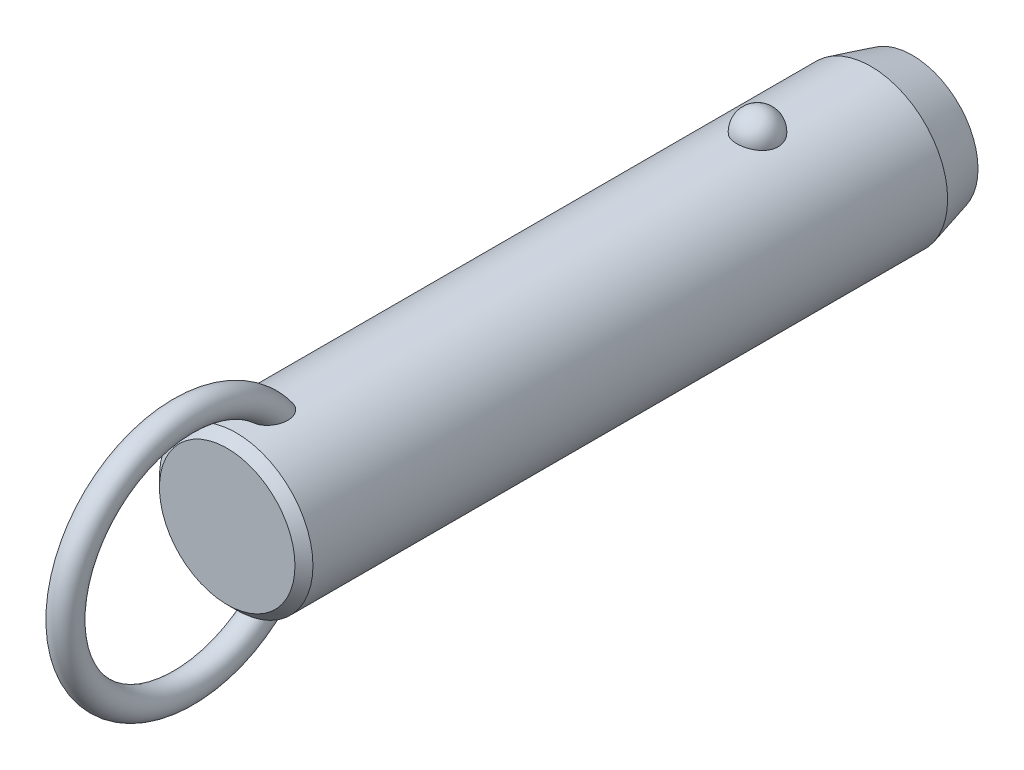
ISO-10303-21;
HEADER;
FILE_DESCRIPTION(('STEP AP214'),'2;1');
FILE_NAME('part.step','',(''),(''),'','','');
FILE_SCHEMA(('AUTOMOTIVE_DESIGN { 1 0 10303 214 1 1 1 1 }'));
ENDSEC;
DATA;
#1=APPLICATION_CONTEXT('core data for automotive mechanical design processes');
#2=APPLICATION_PROTOCOL_DEFINITION('international standard','automotive_design',2000,#1);
#3=PRODUCT_CONTEXT('',#1,'mechanical');
#4=PRODUCT('Part','Part','',(#3));
#5=PRODUCT_RELATED_PRODUCT_CATEGORY('part','',(#4));
#6=PRODUCT_DEFINITION_FORMATION('','',#4);
#7=PRODUCT_DEFINITION_CONTEXT('part definition',#1,'design');
#8=PRODUCT_DEFINITION('design','',#6,#7);
#9=PRODUCT_DEFINITION_SHAPE('','',#8);
#10=(LENGTH_UNIT() NAMED_UNIT(*) SI_UNIT(.MILLI.,.METRE.));
#11=(NAMED_UNIT(*) PLANE_ANGLE_UNIT() SI_UNIT($,.RADIAN.));
#12=(NAMED_UNIT(*) SI_UNIT($,.STERADIAN.) SOLID_ANGLE_UNIT());
#13=UNCERTAINTY_MEASURE_WITH_UNIT(LENGTH_MEASURE(1.E-05),#10,'distance_accuracy_value','');
#14=(GEOMETRIC_REPRESENTATION_CONTEXT(3) GLOBAL_UNCERTAINTY_ASSIGNED_CONTEXT((#13)) GLOBAL_UNIT_ASSIGNED_CONTEXT((#10,
#11,#12)) REPRESENTATION_CONTEXT('',''));
#15=CARTESIAN_POINT('',(0.,0.,0.));
#16=DIRECTION('',(0.,0.,1.));
#17=DIRECTION('',(1.,0.,0.));
#18=AXIS2_PLACEMENT_3D('',#15,#16,#17);
#19=CARTESIAN_POINT('',(0.,0.,61.));
#20=DIRECTION('',(0.,0.,-1.));
#21=DIRECTION('',(-1.,0.,0.));
#22=AXIS2_PLACEMENT_3D('',#19,#20,#21);
#23=CYLINDRICAL_SURFACE('',#22,11.1);
#24=CARTESIAN_POINT('',(2.9724815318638,10.6945945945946,-3.));
#25=CARTESIAN_POINT('',(2.97247830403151,10.6945972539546,-2.83225059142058));
#26=CARTESIAN_POINT('',(2.95876598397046,10.6984356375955,-2.6644597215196));
#27=CARTESIAN_POINT('',(2.90424529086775,10.7133624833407,-2.33362381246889));
#28=CARTESIAN_POINT('',(2.8634252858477,10.7244540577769,-2.1705808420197));
#29=CARTESIAN_POINT('',(2.75573657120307,10.7526272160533,-1.85396767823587));
#30=CARTESIAN_POINT('',(2.68887937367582,10.7697061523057,-1.70039333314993));
#31=CARTESIAN_POINT('',(2.53079696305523,10.8079438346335,-1.40691598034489));
#32=CARTESIAN_POINT('',(2.43957264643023,10.8291024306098,-1.2670124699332));
#33=CARTESIAN_POINT('',(2.23458150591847,10.8732541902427,-1.00409565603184));
#34=CARTESIAN_POINT('',(2.12071295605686,10.8962553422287,-0.881162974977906));
#35=CARTESIAN_POINT('',(1.87365402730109,10.9414421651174,-0.656352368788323));
#36=CARTESIAN_POINT('',(1.74046358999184,10.9636278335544,-0.554474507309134));
#37=CARTESIAN_POINT('',(1.45872188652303,11.0046495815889,-0.374872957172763));
#38=CARTESIAN_POINT('',(1.31021276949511,11.0234944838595,-0.297085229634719));
#39=CARTESIAN_POINT('',(1.00170030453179,11.0557957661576,-0.16752977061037));
#40=CARTESIAN_POINT('',(0.841698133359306,11.0692526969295,-0.115759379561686));
#41=CARTESIAN_POINT('',(0.517607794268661,11.0890932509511,-0.0403925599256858));
#42=CARTESIAN_POINT('',(0.353633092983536,11.0955916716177,-0.0163383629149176));
#43=CARTESIAN_POINT('',(0.0238420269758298,11.1011989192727,0.00445177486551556));
#44=CARTESIAN_POINT('',(-0.141974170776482,11.1003084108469,0.00119017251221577));
#45=CARTESIAN_POINT('',(-0.468405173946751,11.0912990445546,-0.032323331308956));
#46=CARTESIAN_POINT('',(-0.629059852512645,11.0832767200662,-0.0622147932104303));
#47=CARTESIAN_POINT('',(-0.942937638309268,11.0609962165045,-0.147645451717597));
#48=CARTESIAN_POINT('',(-1.09616062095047,11.0467379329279,-0.203185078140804));
#49=CARTESIAN_POINT('',(-1.39181061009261,11.0134071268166,-0.3387529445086));
#50=CARTESIAN_POINT('',(-1.53417383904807,10.9943086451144,-0.418913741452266));
#51=CARTESIAN_POINT('',(-1.80342160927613,10.9533667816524,-0.60144882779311));
#52=CARTESIAN_POINT('',(-1.9303046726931,10.9315231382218,-0.703825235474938));
#53=CARTESIAN_POINT('',(-2.16747598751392,10.887005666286,-0.930091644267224));
#54=CARTESIAN_POINT('',(-2.27742774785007,10.8643239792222,-1.05433291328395));
#55=CARTESIAN_POINT('',(-2.47517316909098,10.8209886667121,-1.31966633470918));
#56=CARTESIAN_POINT('',(-2.56296538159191,10.8003351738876,-1.46075958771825));
#57=CARTESIAN_POINT('',(-2.71500300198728,10.7631304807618,-1.75753646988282));
#58=CARTESIAN_POINT('',(-2.77898901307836,10.7466250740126,-1.91335887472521));
#59=CARTESIAN_POINT('',(-2.88046189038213,10.7198747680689,-2.2339152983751));
#60=CARTESIAN_POINT('',(-2.91794947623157,10.709629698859,-2.39864907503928));
#61=CARTESIAN_POINT('',(-2.96537819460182,10.6965949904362,-2.73165170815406));
#62=CARTESIAN_POINT('',(-2.97542891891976,10.693775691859,-2.89990378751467));
#63=CARTESIAN_POINT('',(-2.96804271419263,10.6958279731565,-3.235752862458));
#64=CARTESIAN_POINT('',(-2.95060646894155,10.7006993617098,-3.40334987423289));
#65=CARTESIAN_POINT('',(-2.88883358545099,10.71753912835,-3.73233906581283));
#66=CARTESIAN_POINT('',(-2.84462026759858,10.7294749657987,-3.89375610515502));
#67=CARTESIAN_POINT('',(-2.73050447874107,10.7590797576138,-4.20667949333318));
#68=CARTESIAN_POINT('',(-2.66060103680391,10.7767489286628,-4.35818546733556));
#69=CARTESIAN_POINT('',(-2.49642559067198,10.8159599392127,-4.6478542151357));
#70=CARTESIAN_POINT('',(-2.40203047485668,10.8375211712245,-4.78594458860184));
#71=CARTESIAN_POINT('',(-2.19143488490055,10.8820570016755,-5.0441038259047));
#72=CARTESIAN_POINT('',(-2.07523364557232,10.9050316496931,-5.16417205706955));
#73=CARTESIAN_POINT('',(-1.82361254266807,10.9499219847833,-5.38334833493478));
#74=CARTESIAN_POINT('',(-1.68812945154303,10.9718338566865,-5.48238464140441));
#75=CARTESIAN_POINT('',(-1.40191298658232,11.0120611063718,-5.65618873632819));
#76=CARTESIAN_POINT('',(-1.25118062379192,11.0303767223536,-5.73095813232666));
#77=CARTESIAN_POINT('',(-0.940570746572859,11.0611653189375,-5.85334725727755));
#78=CARTESIAN_POINT('',(-0.780821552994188,11.0737044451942,-5.90127578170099));
#79=CARTESIAN_POINT('',(-0.455204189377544,11.0918598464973,-5.96992976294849));
#80=CARTESIAN_POINT('',(-0.289336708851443,11.0974768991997,-5.99065827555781));
#81=CARTESIAN_POINT('',(0.0406846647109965,11.1011307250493,-6.00418773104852));
#82=CARTESIAN_POINT('',(0.20481742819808,11.099299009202,-5.99747318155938));
#83=CARTESIAN_POINT('',(0.529553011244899,11.088551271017,-5.9574031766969));
#84=CARTESIAN_POINT('',(0.69015594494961,11.0796354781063,-5.92404858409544));
#85=CARTESIAN_POINT('',(1.0027760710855,11.0557204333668,-5.83180084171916));
#86=CARTESIAN_POINT('',(1.15482001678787,11.0407414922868,-5.77299291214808));
#87=CARTESIAN_POINT('',(1.44678373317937,11.0062913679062,-5.63147366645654));
#88=CARTESIAN_POINT('',(1.58670279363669,10.9868199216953,-5.54876095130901));
#89=CARTESIAN_POINT('',(1.8527023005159,10.9451315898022,-5.36027644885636));
#90=CARTESIAN_POINT('',(1.97855158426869,10.9228788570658,-5.25418644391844));
#91=CARTESIAN_POINT('',(2.21080872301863,10.8782509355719,-5.02251354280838));
#92=CARTESIAN_POINT('',(2.31721312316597,10.8558757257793,-4.89692718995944));
#93=CARTESIAN_POINT('',(2.5094551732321,10.8130715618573,-4.62745408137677));
#94=CARTESIAN_POINT('',(2.59493284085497,10.7926798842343,-4.48330448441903));
#95=CARTESIAN_POINT('',(2.740862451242,10.7565495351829,-4.18236358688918));
#96=CARTESIAN_POINT('',(2.80132490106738,10.7408089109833,-4.02557762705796));
#97=CARTESIAN_POINT('',(2.88959070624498,10.7173718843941,-3.72475308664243));
#98=CARTESIAN_POINT('',(2.92062102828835,10.7088950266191,-3.58171216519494));
#99=CARTESIAN_POINT('',(2.96206765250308,10.6975052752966,-3.29245795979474));
#100=CARTESIAN_POINT('',(2.97248434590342,10.6945922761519,-3.14624473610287));
#101=CARTESIAN_POINT('',(2.9724815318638,10.6945945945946,-3.));
#102=B_SPLINE_CURVE_WITH_KNOTS('',3,(#24,#25,#26,#27,#28,#29,#30,#31,#32,#33,#34,#35,#36,#37,
#38,#39,#40,#41,#42,#43,#44,#45,#46,#47,#48,#49,#50,#51,#52,#53,#54,#55,#56,#57,#58,#59,#60,#61,
#62,#63,#64,#65,#66,#67,#68,#69,#70,#71,#72,#73,#74,#75,#76,#77,#78,#79,#80,#81,#82,#83,#84,#85,
#86,#87,#88,#89,#90,#91,#92,#93,#94,#95,#96,#97,#98,#99,#100,#101),.UNSPECIFIED.,.T.,.F.,(4,2,2,
2,2,2,2,2,2,2,2,2,2,2,2,2,2,2,2,2,2,2,2,2,2,2,2,2,2,2,2,2,2,2,2,2,2,2,4),(0.,0.502722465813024,
1.00566079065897,1.50837699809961,2.01107471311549,2.51608392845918,3.02109467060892,
3.52475118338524,4.02835620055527,4.523518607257,5.0186364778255,5.50715297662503,
5.9956776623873,6.48688002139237,6.97812923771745,7.47814366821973,7.9781907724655,
8.48353712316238,8.9888697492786,9.49218093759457,9.99547960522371,10.4964777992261,
10.997494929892,11.5010810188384,12.0046847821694,12.5099796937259,13.0152411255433,
13.5145635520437,14.0138298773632,14.5043200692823,14.9947943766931,15.4836390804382,
15.9725123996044,16.4685040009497,16.9645836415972,17.4686765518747,17.972557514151,
18.410841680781,18.849117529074),.UNSPECIFIED.);
#103=CARTESIAN_POINT('',(2.9724815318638,10.6945945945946,-3.));
#104=VERTEX_POINT('',#103);
#105=EDGE_CURVE('E41',#104,#104,#102,.T.);
#106=ORIENTED_EDGE('',*,*,#105,.T.);
#107=EDGE_LOOP('',(#106));
#108=FACE_BOUND('',#107,.T.);
#109=CARTESIAN_POINT('',(0.,0.,72.4));
#110=DIRECTION('',(0.,0.,1.));
#111=DIRECTION('',(1.,0.,0.));
#112=AXIS2_PLACEMENT_3D('',#109,#110,#111);
#113=CIRCLE('',#112,11.1);
#114=CARTESIAN_POINT('',(11.1,0.,72.4));
#115=VERTEX_POINT('',#114);
#116=EDGE_CURVE('E10',#115,#115,#113,.F.);
#117=ORIENTED_EDGE('',*,*,#116,.T.);
#118=EDGE_LOOP('',(#117));
#119=FACE_BOUND('',#118,.T.);
#120=CARTESIAN_POINT('',(-0.564520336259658,-11.0856356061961,64.6578154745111));
#121=CARTESIAN_POINT('',(-0.667202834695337,-11.0804062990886,64.6912839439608));
#122=CARTESIAN_POINT('',(-0.766875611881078,-11.0738877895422,64.7338357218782));
#123=CARTESIAN_POINT('',(-0.957284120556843,-11.0590576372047,64.8354190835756));
#124=CARTESIAN_POINT('',(-1.04801616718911,-11.0507452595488,64.8944574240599));
#125=CARTESIAN_POINT('',(-1.21800952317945,-11.0333016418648,65.0265293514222));
#126=CARTESIAN_POINT('',(-1.29730805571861,-11.0241732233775,65.0995156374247));
#127=CARTESIAN_POINT('',(-1.44337665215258,-11.0060026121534,65.2570374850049));
#128=CARTESIAN_POINT('',(-1.51014622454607,-10.9969604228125,65.3415734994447));
#129=CARTESIAN_POINT('',(-1.63454620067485,-10.9791841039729,65.5255213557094));
#130=CARTESIAN_POINT('',(-1.69127003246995,-10.9705107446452,65.6255493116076));
#131=CARTESIAN_POINT('',(-1.78980785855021,-10.9548648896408,65.8327902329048));
#132=CARTESIAN_POINT('',(-1.83161214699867,-10.9478935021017,65.9400078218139));
#133=CARTESIAN_POINT('',(-1.91557028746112,-10.9335803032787,66.2054080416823));
#134=CARTESIAN_POINT('',(-1.95040620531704,-10.9273269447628,66.3659806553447));
#135=CARTESIAN_POINT('',(-1.99388326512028,-10.9194709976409,66.6906977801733));
#136=CARTESIAN_POINT('',(-2.00248051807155,-10.9178762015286,66.8548478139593));
#137=CARTESIAN_POINT('',(-1.99551615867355,-10.9191578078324,67.2246504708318));
#138=CARTESIAN_POINT('',(-1.9732206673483,-10.9232807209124,67.4301911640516));
#139=CARTESIAN_POINT('',(-1.91529761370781,-10.9335244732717,67.733595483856));
#140=CARTESIAN_POINT('',(-1.8918457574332,-10.9376266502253,67.8340883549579));
#141=CARTESIAN_POINT('',(-1.83700674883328,-10.9469720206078,68.032855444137));
#142=CARTESIAN_POINT('',(-1.80562070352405,-10.9522150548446,68.1311299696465));
#143=CARTESIAN_POINT('',(-1.73463055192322,-10.9636837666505,68.3259148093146));
#144=CARTESIAN_POINT('',(-1.6949341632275,-10.9699202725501,68.4223907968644));
#145=CARTESIAN_POINT('',(-1.6074514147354,-10.9830806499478,68.6116262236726));
#146=CARTESIAN_POINT('',(-1.55966150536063,-10.9900048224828,68.7043840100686));
#147=CARTESIAN_POINT('',(-1.45591812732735,-11.0042280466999,68.8846907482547));
#148=CARTESIAN_POINT('',(-1.40000013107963,-11.0115253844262,68.9722601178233));
#149=CARTESIAN_POINT('',(-1.27937470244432,-11.0261911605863,69.1410298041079));
#150=CARTESIAN_POINT('',(-1.21467835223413,-11.0335594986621,69.2222379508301));
#151=CARTESIAN_POINT('',(-1.08218150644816,-11.0473027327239,69.3690010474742));
#152=CARTESIAN_POINT('',(-1.01522633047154,-11.0537063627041,69.435309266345));
#153=CARTESIAN_POINT('',(-0.872952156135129,-11.065850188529,69.5583780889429));
#154=CARTESIAN_POINT('',(-0.797642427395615,-11.0715911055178,69.6151491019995));
#155=CARTESIAN_POINT('',(-0.651396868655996,-11.081071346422,69.7075155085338));
#156=CARTESIAN_POINT('',(-0.581712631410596,-11.0849841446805,69.7450491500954));
#157=CARTESIAN_POINT('',(-0.437066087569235,-11.0916271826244,69.8082594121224));
#158=CARTESIAN_POINT('',(-0.362109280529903,-11.0943586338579,69.8339481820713));
#159=CARTESIAN_POINT('',(-0.20782800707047,-11.0983242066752,69.871117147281));
#160=CARTESIAN_POINT('',(-0.128467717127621,-11.0995432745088,69.8824545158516));
#161=CARTESIAN_POINT('',(0.0309101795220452,-11.1002423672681,69.8889658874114));
#162=CARTESIAN_POINT('',(0.110927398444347,-11.0997233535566,69.8841488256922));
#163=CARTESIAN_POINT('',(0.256406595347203,-11.097240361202,69.8609599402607));
#164=CARTESIAN_POINT('',(0.322235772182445,-11.0955074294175,69.8447543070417));
#165=CARTESIAN_POINT('',(0.45063593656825,-11.0910350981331,69.8026008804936));
#166=CARTESIAN_POINT('',(0.5132052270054,-11.0882951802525,69.7766480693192));
#167=CARTESIAN_POINT('',(0.662626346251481,-11.0805620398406,69.7026073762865));
#168=CARTESIAN_POINT('',(0.747127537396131,-11.0751144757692,69.6498452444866));
#169=CARTESIAN_POINT('',(0.906756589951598,-11.0631932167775,69.5317206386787));
#170=CARTESIAN_POINT('',(0.981859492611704,-11.0567168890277,69.4663257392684));
#171=CARTESIAN_POINT('',(1.10712207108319,-11.0447856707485,69.3422633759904));
#172=CARTESIAN_POINT('',(1.15909566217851,-11.0394280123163,69.2853831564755));
#173=CARTESIAN_POINT('',(1.25791923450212,-11.0286040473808,69.1673271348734));
#174=CARTESIAN_POINT('',(1.30476642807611,-11.0231376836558,69.1061490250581));
#175=CARTESIAN_POINT('',(1.43818612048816,-11.0068027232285,68.917305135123));
#176=CARTESIAN_POINT('',(1.5175176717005,-10.9960104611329,68.7844531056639));
#177=CARTESIAN_POINT('',(1.63597546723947,-10.9788847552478,68.5531371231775));
#178=CARTESIAN_POINT('',(1.6798887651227,-10.9722190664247,68.4570530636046));
#179=CARTESIAN_POINT('',(1.75953241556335,-10.9597298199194,68.2614311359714));
#180=CARTESIAN_POINT('',(1.79525967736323,-10.9539065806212,68.1618919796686));
#181=CARTESIAN_POINT('',(1.85844731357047,-10.9433632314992,67.9602111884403));
#182=CARTESIAN_POINT('',(1.88591073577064,-10.9386427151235,67.8580705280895));
#183=CARTESIAN_POINT('',(1.9323432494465,-10.9305350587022,67.6518191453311));
#184=CARTESIAN_POINT('',(1.95131065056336,-10.9271481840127,67.5477080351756));
#185=CARTESIAN_POINT('',(1.99040203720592,-10.9201183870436,67.2654588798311));
#186=CARTESIAN_POINT('',(2.00221217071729,-10.9179256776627,67.0860370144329));
#187=CARTESIAN_POINT('',(1.99711676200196,-10.9188636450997,66.7277133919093));
#188=CARTESIAN_POINT('',(1.98026150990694,-10.9219849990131,66.548811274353));
#189=CARTESIAN_POINT('',(1.92151657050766,-10.9324473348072,66.2364514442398));
#190=CARTESIAN_POINT('',(1.88605081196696,-10.9386915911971,66.1017594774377));
#191=CARTESIAN_POINT('',(1.7939302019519,-10.9541780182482,65.8399669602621));
#192=CARTESIAN_POINT('',(1.73729868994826,-10.9634168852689,65.7128582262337));
#193=CARTESIAN_POINT('',(1.61237037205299,-10.9824218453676,65.4894184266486));
#194=CARTESIAN_POINT('',(1.54715374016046,-10.9918945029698,65.3913455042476));
#195=CARTESIAN_POINT('',(1.40127026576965,-11.0114415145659,65.2074341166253));
#196=CARTESIAN_POINT('',(1.32060742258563,-11.0215157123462,65.1215924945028));
#197=CARTESIAN_POINT('',(1.14474787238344,-11.041168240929,64.9651630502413));
#198=CARTESIAN_POINT('',(1.04947805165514,-11.0507437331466,64.8946565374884));
#199=CARTESIAN_POINT('',(0.847278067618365,-11.0680789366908,64.772640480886));
#200=CARTESIAN_POINT('',(0.740351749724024,-11.0758392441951,64.7211246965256));
#201=CARTESIAN_POINT('',(0.52928931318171,-11.0878275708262,64.6434852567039));
#202=CARTESIAN_POINT('',(0.425895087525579,-11.0923259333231,64.615377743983));
#203=CARTESIAN_POINT('',(0.215723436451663,-11.0984001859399,64.5777038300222));
#204=CARTESIAN_POINT('',(0.108947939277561,-11.0999777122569,64.5681270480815));
#205=CARTESIAN_POINT('',(-0.0938962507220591,-11.1000196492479,64.5678773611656));
#206=CARTESIAN_POINT('',(-0.189967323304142,-11.0987797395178,64.5754089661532));
#207=CARTESIAN_POINT('',(-0.379657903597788,-11.0939111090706,64.6055079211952));
#208=CARTESIAN_POINT('',(-0.473277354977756,-11.0902823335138,64.6280756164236));
#209=CARTESIAN_POINT('',(-0.564520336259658,-11.0856356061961,64.6578154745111));
#210=B_SPLINE_CURVE_WITH_KNOTS('',3,(#120,#121,#122,#123,#124,#125,#126,#127,#128,#129,#130,
#131,#132,#133,#134,#135,#136,#137,#138,#139,#140,#141,#142,#143,#144,#145,#146,#147,#148,#149,
#150,#151,#152,#153,#154,#155,#156,#157,#158,#159,#160,#161,#162,#163,#164,#165,#166,#167,#168,
#169,#170,#171,#172,#173,#174,#175,#176,#177,#178,#179,#180,#181,#182,#183,#184,#185,#186,#187,
#188,#189,#190,#191,#192,#193,#194,#195,#196,#197,#198,#199,#200,#201,#202,#203,#204,#205,#206,
#207,#208,#209),.UNSPECIFIED.,.T.,.F.,(4,2,2,2,2,2,2,2,2,2,2,2,2,2,2,2,2,2,2,2,2,2,2,2,2,2,2,2,
2,2,2,2,2,2,2,2,2,2,2,2,2,2,2,2,4),(0.,0.323999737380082,0.648132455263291,0.971184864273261,
1.29424994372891,1.6388623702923,1.98369857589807,2.47426059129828,2.96564271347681,
3.58257396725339,3.89215258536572,4.20168803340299,4.51486273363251,4.82817514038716,
5.14015911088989,5.45175282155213,5.73442856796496,6.01679375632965,6.2536458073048,
6.49025437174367,6.72919963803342,6.96801276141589,7.1706125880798,7.37331685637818,
7.6709498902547,7.96935728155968,8.20075067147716,8.4322692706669,8.89581623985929,
9.21306533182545,9.53043400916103,9.84768549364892,10.1650000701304,10.70229304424,
11.2386443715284,11.6553390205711,12.0715755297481,12.4245637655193,12.7774607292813,
13.1321855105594,13.4867936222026,13.8068771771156,14.1267813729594,14.4146787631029,
14.7025827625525),.UNSPECIFIED.);
#211=CARTESIAN_POINT('',(-0.564520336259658,-11.0856356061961,64.6578154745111));
#212=VERTEX_POINT('',#211);
#213=EDGE_CURVE('E60',#212,#212,#210,.T.);
#214=ORIENTED_EDGE('',*,*,#213,.T.);
#215=EDGE_LOOP('',(#214));
#216=FACE_BOUND('',#215,.T.);
#217=CARTESIAN_POINT('',(-0.564520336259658,11.0856356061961,64.6578154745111));
#218=CARTESIAN_POINT('',(-0.468542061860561,11.0905203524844,64.6265456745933));
#219=CARTESIAN_POINT('',(-0.369793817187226,11.0942886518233,64.6031576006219));
#220=CARTESIAN_POINT('',(-0.169555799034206,11.0991586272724,64.5730858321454));
#221=CARTESIAN_POINT('',(-0.0680604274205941,11.1002543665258,64.5664393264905));
#222=CARTESIAN_POINT('',(0.134549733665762,11.099646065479,64.5701579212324));
#223=CARTESIAN_POINT('',(0.235664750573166,11.0979441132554,64.5805103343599));
#224=CARTESIAN_POINT('',(0.43463240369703,11.0919342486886,64.6178318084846));
#225=CARTESIAN_POINT('',(0.532486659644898,11.0876276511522,64.6447924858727));
#226=CARTESIAN_POINT('',(0.722445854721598,11.0768742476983,64.7144096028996));
#227=CARTESIAN_POINT('',(0.814543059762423,11.0704246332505,64.7570866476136));
#228=CARTESIAN_POINT('',(0.990565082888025,11.0560659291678,64.8566487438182));
#229=CARTESIAN_POINT('',(1.07448844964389,11.048156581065,64.9135363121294));
#230=CARTESIAN_POINT('',(1.23562672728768,11.0313221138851,65.0422106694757));
#231=CARTESIAN_POINT('',(1.31242684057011,11.0223686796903,65.1145117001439));
#232=CARTESIAN_POINT('',(1.45398030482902,11.0045918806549,65.2700425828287));
#233=CARTESIAN_POINT('',(1.51873073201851,10.9957685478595,65.3532750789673));
#234=CARTESIAN_POINT('',(1.64107232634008,10.9782087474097,65.5363842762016));
#235=CARTESIAN_POINT('',(1.6974317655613,10.9695572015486,65.6370893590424));
#236=CARTESIAN_POINT('',(1.79515063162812,10.9539887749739,65.8456264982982));
#237=CARTESIAN_POINT('',(1.83649966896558,10.9470730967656,65.9534634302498));
#238=CARTESIAN_POINT('',(1.91931148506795,10.9329211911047,66.2203995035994));
#239=CARTESIAN_POINT('',(1.9534010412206,10.9267904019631,66.3818612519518));
#240=CARTESIAN_POINT('',(1.99526195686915,10.9192174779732,66.7082163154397));
#241=CARTESIAN_POINT('',(2.00298989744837,10.9177830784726,66.8731148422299));
#242=CARTESIAN_POINT('',(1.9939625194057,10.9194420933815,67.2441006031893));
#243=CARTESIAN_POINT('',(1.9705082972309,10.923774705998,67.4500387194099));
#244=CARTESIAN_POINT('',(1.91079643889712,10.9343131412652,67.7539019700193));
#245=CARTESIAN_POINT('',(1.88673702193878,10.9385106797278,67.8545296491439));
#246=CARTESIAN_POINT('',(1.83065508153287,10.9480376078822,68.0535107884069));
#247=CARTESIAN_POINT('',(1.79863369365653,10.9533668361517,68.151864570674));
#248=CARTESIAN_POINT('',(1.72633365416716,10.9649954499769,68.346720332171));
#249=CARTESIAN_POINT('',(1.68596409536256,10.9713053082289,68.4431879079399));
#250=CARTESIAN_POINT('',(1.59707998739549,10.9845964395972,68.632323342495));
#251=CARTESIAN_POINT('',(1.54856169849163,10.9915780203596,68.7249894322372));
#252=CARTESIAN_POINT('',(1.44330168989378,11.0058935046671,68.9049752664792));
#253=CARTESIAN_POINT('',(1.38659749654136,11.0132257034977,68.992316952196));
#254=CARTESIAN_POINT('',(1.26431158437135,11.0279330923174,69.1604563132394));
#255=CARTESIAN_POINT('',(1.19874160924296,11.0353082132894,69.2412624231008));
#256=CARTESIAN_POINT('',(1.06542088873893,11.0489310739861,69.3859856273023));
#257=CARTESIAN_POINT('',(0.998640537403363,11.0552153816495,69.450784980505));
#258=CARTESIAN_POINT('',(0.856896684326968,11.0671032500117,69.570846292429));
#259=CARTESIAN_POINT('',(0.781942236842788,11.0727075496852,69.6261186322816));
#260=CARTESIAN_POINT('',(0.636276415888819,11.081949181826,69.7159721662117));
#261=CARTESIAN_POINT('',(0.566755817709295,11.0857572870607,69.7524410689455));
#262=CARTESIAN_POINT('',(0.422602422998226,11.0921860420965,69.8135333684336));
#263=CARTESIAN_POINT('',(0.347974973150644,11.0948079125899,69.8381689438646));
#264=CARTESIAN_POINT('',(0.194593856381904,11.0985608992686,69.8733233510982));
#265=CARTESIAN_POINT('',(0.11580793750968,11.0996777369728,69.8837069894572));
#266=CARTESIAN_POINT('',(-0.0422499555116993,11.1002003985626,69.8885747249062));
#267=CARTESIAN_POINT('',(-0.121521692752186,11.09960699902,69.883066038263));
#268=CARTESIAN_POINT('',(-0.266046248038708,11.0970123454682,69.8588271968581));
#269=CARTESIAN_POINT('',(-0.33166169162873,11.0952283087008,69.8421356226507));
#270=CARTESIAN_POINT('',(-0.459588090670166,11.0906663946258,69.7991117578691));
#271=CARTESIAN_POINT('',(-0.521897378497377,11.0878880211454,69.772774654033));
#272=CARTESIAN_POINT('',(-0.671446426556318,11.0800342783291,69.6975130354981));
#273=CARTESIAN_POINT('',(-0.756250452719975,11.0744969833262,69.6438182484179));
#274=CARTESIAN_POINT('',(-0.916349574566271,11.0624045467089,69.5238029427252));
#275=CARTESIAN_POINT('',(-0.99161892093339,11.0558467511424,69.4574493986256));
#276=CARTESIAN_POINT('',(-1.11713140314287,11.0437783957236,69.3316335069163));
#277=CARTESIAN_POINT('',(-1.16920539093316,11.0383619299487,69.2739524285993));
#278=CARTESIAN_POINT('',(-1.26817476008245,11.02743010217,69.1542809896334));
#279=CARTESIAN_POINT('',(-1.31506731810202,11.0219146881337,69.0922883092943));
#280=CARTESIAN_POINT('',(-1.40399813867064,11.0109399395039,68.9647843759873));
#281=CARTESIAN_POINT('',(-1.44602864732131,11.0054807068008,68.8992677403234));
#282=CARTESIAN_POINT('',(-1.52538779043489,10.9947621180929,68.7654223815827));
#283=CARTESIAN_POINT('',(-1.56271516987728,10.9895028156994,68.6970929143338));
#284=CARTESIAN_POINT('',(-1.64537943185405,10.9774790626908,68.5332101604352));
#285=CARTESIAN_POINT('',(-1.6887949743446,10.9708503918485,68.4366735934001));
#286=CARTESIAN_POINT('',(-1.76740738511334,10.9584602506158,68.2402369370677));
#287=CARTESIAN_POINT('',(-1.80260120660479,10.95269910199,68.1403356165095));
#288=CARTESIAN_POINT('',(-1.86468657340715,10.9423003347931,67.9379663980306));
#289=CARTESIAN_POINT('',(-1.89158164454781,10.9376622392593,67.8354996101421));
#290=CARTESIAN_POINT('',(-1.93682458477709,10.9297405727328,67.6286429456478));
#291=CARTESIAN_POINT('',(-1.9551708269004,10.9264572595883,67.524252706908));
#292=CARTESIAN_POINT('',(-1.99232562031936,10.9197647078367,67.2426287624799));
#293=CARTESIAN_POINT('',(-2.00294603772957,10.9177914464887,67.0641857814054));
#294=CARTESIAN_POINT('',(-1.99566675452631,10.9191290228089,66.7079962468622));
#295=CARTESIAN_POINT('',(-1.97781651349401,10.9224306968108,66.5302490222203));
#296=CARTESIAN_POINT('',(-1.91747214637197,10.93315926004,66.2197921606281));
#297=CARTESIAN_POINT('',(-1.88131022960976,10.9395108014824,66.0858251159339));
#298=CARTESIAN_POINT('',(-1.78790380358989,10.9551659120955,65.8255975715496));
#299=CARTESIAN_POINT('',(-1.73068309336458,10.9644661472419,65.6993285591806));
#300=CARTESIAN_POINT('',(-1.60475573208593,10.9835398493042,65.4774156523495));
#301=CARTESIAN_POINT('',(-1.53908879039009,10.9930297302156,65.3800265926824));
#302=CARTESIAN_POINT('',(-1.39238608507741,11.0125708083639,65.1975250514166));
#303=CARTESIAN_POINT('',(-1.31135150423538,11.0226219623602,65.1124116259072));
#304=CARTESIAN_POINT('',(-1.14382035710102,11.0411991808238,64.9652994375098));
#305=CARTESIAN_POINT('',(-1.05858500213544,11.0497792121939,64.9018693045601));
#306=CARTESIAN_POINT('',(-0.878723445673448,11.0655285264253,64.7902505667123));
#307=CARTESIAN_POINT('',(-0.784123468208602,11.0727015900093,64.7420208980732));
#308=CARTESIAN_POINT('',(-0.64616369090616,11.0812501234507,64.686023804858));
#309=CARTESIAN_POINT('',(-0.605595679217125,11.0835451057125,64.6711978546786));
#310=CARTESIAN_POINT('',(-0.564520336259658,11.0856356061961,64.6578154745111));
#311=B_SPLINE_CURVE_WITH_KNOTS('',3,(#217,#218,#219,#220,#221,#222,#223,#224,#225,#226,#227,
#228,#229,#230,#231,#232,#233,#234,#235,#236,#237,#238,#239,#240,#241,#242,#243,#244,#245,#246,
#247,#248,#249,#250,#251,#252,#253,#254,#255,#256,#257,#258,#259,#260,#261,#262,#263,#264,#265,
#266,#267,#268,#269,#270,#271,#272,#273,#274,#275,#276,#277,#278,#279,#280,#281,#282,#283,#284,
#285,#286,#287,#288,#289,#290,#291,#292,#293,#294,#295,#296,#297,#298,#299,#300,#301,#302,#303,
#304,#305,#306,#307,#308,#309,#310),.UNSPECIFIED.,.T.,.F.,(4,2,2,2,2,2,2,2,2,2,2,2,2,2,2,2,2,2,
2,2,2,2,2,2,2,2,2,2,2,2,2,2,2,2,2,2,2,2,2,2,2,2,2,2,2,2,4),(0.,0.303061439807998,
0.606795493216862,0.910302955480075,1.21365733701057,1.51741085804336,1.82121821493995,
2.13745205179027,2.45376252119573,2.79958678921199,3.14564996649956,3.63832391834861,
4.13180893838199,4.75031912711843,5.06071926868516,5.37107516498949,5.68500772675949,
5.99908475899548,6.31176519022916,6.62403542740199,6.90315673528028,7.1819719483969,
7.41687778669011,7.65154134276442,7.88841587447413,8.12518286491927,8.32752842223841,
8.52997509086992,8.82986421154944,9.13054668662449,9.36393502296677,9.59744991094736,
9.83133221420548,10.0652767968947,10.383032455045,10.7009056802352,11.0186436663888,
11.3364420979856,11.8705925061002,12.4038159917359,12.8189662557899,13.2336487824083,
13.5857049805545,13.9377340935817,14.2561354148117,14.5736690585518,14.7033687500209),.UNSPECIFIED.);
#312=CARTESIAN_POINT('',(-0.564520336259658,11.0856356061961,64.6578154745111));
#313=VERTEX_POINT('',#312);
#314=EDGE_CURVE('E67',#313,#313,#311,.T.);
#315=ORIENTED_EDGE('',*,*,#314,.T.);
#316=EDGE_LOOP('',(#315));
#317=FACE_BOUND('',#316,.T.);
#318=CARTESIAN_POINT('',(0.,0.,-19.4));
#319=DIRECTION('',(0.,0.,-1.));
#320=DIRECTION('',(-1.,0.,0.));
#321=AXIS2_PLACEMENT_3D('',#318,#319,#320);
#322=CIRCLE('',#321,11.1);
#323=CARTESIAN_POINT('',(11.1,0.,-19.4));
#324=VERTEX_POINT('',#323);
#325=EDGE_CURVE('E57',#324,#324,#322,.F.);
#326=ORIENTED_EDGE('',*,*,#325,.T.);
#327=EDGE_LOOP('',(#326));
#328=FACE_BOUND('',#327,.T.);
#329=ADVANCED_FACE('F37',(#108,#119,#216,#317,#328),#23,.T.);
#330=CARTESIAN_POINT('',(0.,0.,-25.4));
#331=DIRECTION('',(0.,0.,-1.));
#332=DIRECTION('',(-1.,0.,0.));
#333=AXIS2_PLACEMENT_3D('',#330,#331,#332);
#334=PLANE('',#333);
#335=CARTESIAN_POINT('',(0.,0.,-25.4));
#336=DIRECTION('',(0.,0.,-1.));
#337=DIRECTION('',(-1.,0.,0.));
#338=AXIS2_PLACEMENT_3D('',#335,#336,#337);
#339=CIRCLE('',#338,9.49230484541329);
#340=CARTESIAN_POINT('',(9.49230484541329,0.,-25.4));
#341=VERTEX_POINT('',#340);
#342=EDGE_CURVE('E66',#341,#341,#339,.T.);
#343=ORIENTED_EDGE('',*,*,#342,.T.);
#344=EDGE_LOOP('',(#343));
#345=FACE_BOUND('',#344,.T.);
#346=ADVANCED_FACE('F85',(#345),#334,.T.);
#347=CARTESIAN_POINT('',(0.,0.,-25.4));
#348=DIRECTION('',(0.,0.,1.));
#349=DIRECTION('',(1.,0.,0.));
#350=AXIS2_PLACEMENT_3D('',#347,#348,#349);
#351=CONICAL_SURFACE('',#350,9.49230484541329,0.261799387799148);
#352=CARTESIAN_POINT('',(11.1,0.,-19.4));
#353=CARTESIAN_POINT('',(11.0832531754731,0.,-19.4625));
#354=CARTESIAN_POINT('',(11.0665063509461,0.,-19.525));
#355=CARTESIAN_POINT('',(11.0330127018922,0.,-19.65));
#356=CARTESIAN_POINT('',(11.0162658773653,0.,-19.7125));
#357=CARTESIAN_POINT('',(10.9827722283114,0.,-19.8375));
#358=CARTESIAN_POINT('',(10.9660254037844,0.,-19.9));
#359=CARTESIAN_POINT('',(10.9325317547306,0.,-20.025));
#360=CARTESIAN_POINT('',(10.9157849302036,0.,-20.0875));
#361=CARTESIAN_POINT('',(10.8822912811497,0.,-20.2125));
#362=CARTESIAN_POINT('',(10.8655444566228,0.,-20.275));
#363=CARTESIAN_POINT('',(10.8320508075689,0.,-20.4));
#364=CARTESIAN_POINT('',(10.8153039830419,0.,-20.4625));
#365=CARTESIAN_POINT('',(10.781810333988,0.,-20.5875));
#366=CARTESIAN_POINT('',(10.7650635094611,0.,-20.65));
#367=CARTESIAN_POINT('',(10.7315698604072,0.,-20.775));
#368=CARTESIAN_POINT('',(10.7148230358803,0.,-20.8375));
#369=CARTESIAN_POINT('',(10.6813293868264,0.,-20.9625));
#370=CARTESIAN_POINT('',(10.6645825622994,0.,-21.025));
#371=CARTESIAN_POINT('',(10.6310889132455,0.,-21.15));
#372=CARTESIAN_POINT('',(10.6143420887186,0.,-21.2125));
#373=CARTESIAN_POINT('',(10.5808484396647,0.,-21.3375));
#374=CARTESIAN_POINT('',(10.5641016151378,0.,-21.4));
#375=CARTESIAN_POINT('',(10.5306079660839,0.,-21.525));
#376=CARTESIAN_POINT('',(10.5138611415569,0.,-21.5875));
#377=CARTESIAN_POINT('',(10.480367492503,0.,-21.7125));
#378=CARTESIAN_POINT('',(10.4636206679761,0.,-21.775));
#379=CARTESIAN_POINT('',(10.4301270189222,0.,-21.9));
#380=CARTESIAN_POINT('',(10.4133801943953,0.,-21.9625));
#381=CARTESIAN_POINT('',(10.3798865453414,0.,-22.0875));
#382=CARTESIAN_POINT('',(10.3631397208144,0.,-22.15));
#383=CARTESIAN_POINT('',(10.3296460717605,0.,-22.275));
#384=CARTESIAN_POINT('',(10.3128992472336,0.,-22.3375));
#385=CARTESIAN_POINT('',(10.2794055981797,0.,-22.4625));
#386=CARTESIAN_POINT('',(10.2626587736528,0.,-22.525));
#387=CARTESIAN_POINT('',(10.2291651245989,0.,-22.65));
#388=CARTESIAN_POINT('',(10.2124183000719,0.,-22.7125));
#389=CARTESIAN_POINT('',(10.178924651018,0.,-22.8375));
#390=CARTESIAN_POINT('',(10.1621778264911,0.,-22.9));
#391=CARTESIAN_POINT('',(10.1286841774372,0.,-23.025));
#392=CARTESIAN_POINT('',(10.1119373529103,0.,-23.0875));
#393=CARTESIAN_POINT('',(10.0784437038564,0.,-23.2125));
#394=CARTESIAN_POINT('',(10.0616968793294,0.,-23.275));
#395=CARTESIAN_POINT('',(10.0282032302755,0.,-23.4));
#396=CARTESIAN_POINT('',(10.0114564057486,0.,-23.4625));
#397=CARTESIAN_POINT('',(9.97796275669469,0.,-23.5875));
#398=CARTESIAN_POINT('',(9.96121593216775,0.,-23.65));
#399=CARTESIAN_POINT('',(9.92772228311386,0.,-23.775));
#400=CARTESIAN_POINT('',(9.91097545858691,0.,-23.8375));
#401=CARTESIAN_POINT('',(9.87748180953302,0.,-23.9625));
#402=CARTESIAN_POINT('',(9.86073498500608,0.,-24.025));
#403=CARTESIAN_POINT('',(9.82724133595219,0.,-24.15));
#404=CARTESIAN_POINT('',(9.81049451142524,0.,-24.2125));
#405=CARTESIAN_POINT('',(9.77700086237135,0.,-24.3375));
#406=CARTESIAN_POINT('',(9.76025403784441,0.,-24.4));
#407=CARTESIAN_POINT('',(9.72676038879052,0.,-24.525));
#408=CARTESIAN_POINT('',(9.71001356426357,0.,-24.5875));
#409=CARTESIAN_POINT('',(9.67651991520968,0.,-24.7125));
#410=CARTESIAN_POINT('',(9.65977309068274,0.,-24.775));
#411=CARTESIAN_POINT('',(9.62627944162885,0.,-24.9));
#412=CARTESIAN_POINT('',(9.6095326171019,0.,-24.9625));
#413=CARTESIAN_POINT('',(9.57603896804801,0.,-25.0875));
#414=CARTESIAN_POINT('',(9.55929214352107,0.,-25.15));
#415=CARTESIAN_POINT('',(9.52579849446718,0.,-25.275));
#416=CARTESIAN_POINT('',(9.50905166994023,0.,-25.3375));
#417=CARTESIAN_POINT('',(9.49230484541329,0.,-25.4));
#418=B_SPLINE_CURVE_WITH_KNOTS('',3,(#352,#353,#354,#355,#356,#357,#358,#359,#360,#361,#362,
#363,#364,#365,#366,#367,#368,#369,#370,#371,#372,#373,#374,#375,#376,#377,#378,#379,#380,#381,
#382,#383,#384,#385,#386,#387,#388,#389,#390,#391,#392,#393,#394,#395,#396,#397,#398,#399,#400,
#401,#402,#403,#404,#405,#406,#407,#408,#409,#410,#411,#412,#413,#414,#415,#416,#417),
.UNSPECIFIED.,.F.,.F.,(4,2,2,2,2,2,2,2,2,2,2,2,2,2,2,2,2,2,2,2,2,2,2,2,2,2,2,2,2,2,2,2,4),(0.,
0.194114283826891,0.388228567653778,0.582342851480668,0.776457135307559,0.970571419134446,
1.16468570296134,1.35879998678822,1.55291427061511,1.74702855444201,1.94114283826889,
2.13525712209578,2.32937140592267,2.52348568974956,2.71759997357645,2.91171425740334,
3.10582854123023,3.29994282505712,3.49405710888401,3.68817139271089,3.88228567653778,
4.07639996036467,4.27051424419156,4.46462852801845,4.65874281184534,4.85285709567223,
5.04697137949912,5.24108566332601,5.4351999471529,5.62931423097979,5.82342851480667,
6.01754279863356,6.21165708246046),.UNSPECIFIED.);
#419=EDGE_CURVE('BSEAM83',#324,#341,#418,.T.);
#420=ORIENTED_EDGE('',*,*,#325,.F.);
#421=ORIENTED_EDGE('',*,*,#342,.F.);
#422=ORIENTED_EDGE('',*,*,#419,.T.);
#423=ORIENTED_EDGE('',*,*,#419,.F.);
#424=EDGE_LOOP('',(#420,#422,#421,#423));
#425=FACE_BOUND('',#424,.T.);
#426=ADVANCED_FACE('F83',(#425),#351,.T.);
#427=CARTESIAN_POINT('',(0.,0.,73.7));
#428=DIRECTION('',(0.,0.,1.));
#429=DIRECTION('',(1.,0.,0.));
#430=AXIS2_PLACEMENT_3D('',#427,#428,#429);
#431=PLANE('',#430);
#432=CARTESIAN_POINT('',(0.,0.,73.7));
#433=DIRECTION('',(0.,0.,1.));
#434=DIRECTION('',(1.,0.,0.));
#435=AXIS2_PLACEMENT_3D('',#432,#433,#434);
#436=CIRCLE('',#435,9.80000000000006);
#437=CARTESIAN_POINT('',(9.80000000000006,0.,73.7));
#438=VERTEX_POINT('',#437);
#439=EDGE_CURVE('E50',#438,#438,#436,.T.);
#440=ORIENTED_EDGE('',*,*,#439,.T.);
#441=EDGE_LOOP('',(#440));
#442=FACE_BOUND('',#441,.T.);
#443=ADVANCED_FACE('F77',(#442),#431,.T.);
#444=CARTESIAN_POINT('',(0.,0.,80.05));
#445=DIRECTION('',(1.,0.,0.));
#446=DIRECTION('',(0.,0.,-1.));
#447=AXIS2_PLACEMENT_3D('',#444,#445,#446);
#448=TOROIDAL_SURFACE('',#447,17.05,2.);
#449=ORIENTED_EDGE('',*,*,#314,.F.);
#450=EDGE_LOOP('',(#449));
#451=FACE_BOUND('',#450,.T.);
#452=ORIENTED_EDGE('',*,*,#213,.F.);
#453=EDGE_LOOP('',(#452));
#454=FACE_BOUND('',#453,.T.);
#455=ADVANCED_FACE('F73',(#451,#454),#448,.T.);
#456=CARTESIAN_POINT('',(0.,0.,73.7));
#457=DIRECTION('',(0.,0.,-1.));
#458=DIRECTION('',(-1.,0.,0.));
#459=AXIS2_PLACEMENT_3D('',#456,#457,#458);
#460=CONICAL_SURFACE('',#459,9.80000000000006,0.785398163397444);
#461=ORIENTED_EDGE('',*,*,#116,.F.);
#462=EDGE_LOOP('',(#461));
#463=FACE_BOUND('',#462,.T.);
#464=ORIENTED_EDGE('',*,*,#439,.F.);
#465=EDGE_LOOP('',(#464));
#466=FACE_BOUND('',#465,.T.);
#467=ADVANCED_FACE('F39',(#463,#466),#460,.T.);
#468=CARTESIAN_POINT('',(0.,11.1,-3.));
#469=DIRECTION('',(0.,1.,0.));
#470=DIRECTION('',(0.,0.,-1.));
#471=AXIS2_PLACEMENT_3D('',#468,#469,#470);
#472=SPHERICAL_SURFACE('',#471,3.);
#473=ORIENTED_EDGE('',*,*,#105,.F.);
#474=EDGE_LOOP('',(#473));
#475=FACE_BOUND('',#474,.T.);
#476=ADVANCED_FACE('F79',(#475),#472,.T.);
#477=CLOSED_SHELL('',(#329,#346,#426,#443,#455,#467,#476));
#478=MANIFOLD_SOLID_BREP('B2',#477);
#479=ADVANCED_BREP_SHAPE_REPRESENTATION('',(#18,#478),#14);
#480=SHAPE_DEFINITION_REPRESENTATION(#9,#479);
ENDSEC;
END-ISO-10303-21;
